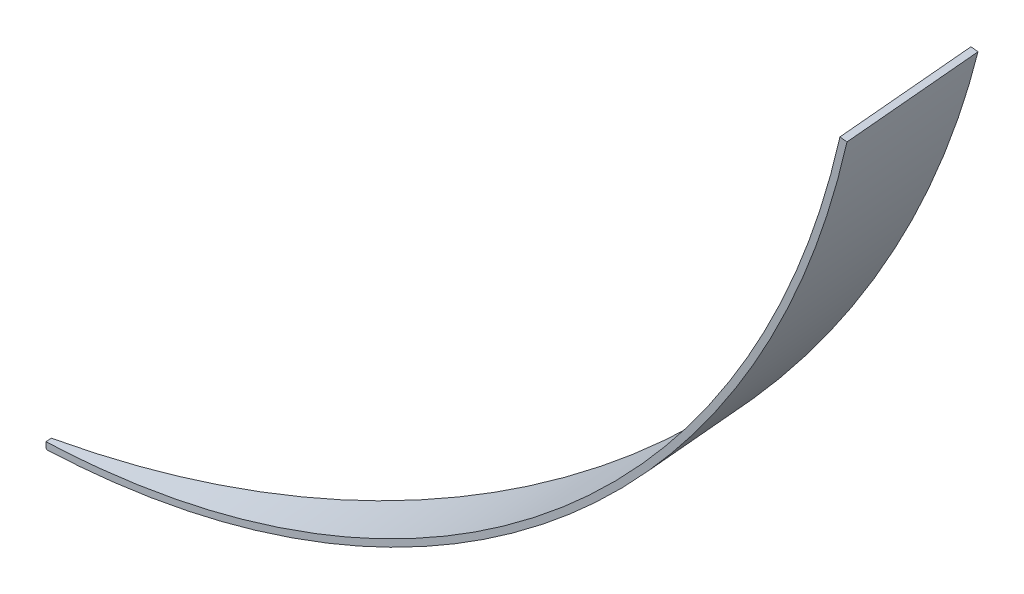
ISO-10303-21;
HEADER;
FILE_DESCRIPTION(('STEP AP214'),'2;1');
FILE_NAME('part.step','',(''),(''),'','','');
FILE_SCHEMA(('AUTOMOTIVE_DESIGN { 1 0 10303 214 1 1 1 1 }'));
ENDSEC;
DATA;
#1=APPLICATION_CONTEXT('core data for automotive mechanical design processes');
#2=APPLICATION_PROTOCOL_DEFINITION('international standard','automotive_design',2000,#1);
#3=PRODUCT_CONTEXT('',#1,'mechanical');
#4=PRODUCT('Part','Part','',(#3));
#5=PRODUCT_RELATED_PRODUCT_CATEGORY('part','',(#4));
#6=PRODUCT_DEFINITION_FORMATION('','',#4);
#7=PRODUCT_DEFINITION_CONTEXT('part definition',#1,'design');
#8=PRODUCT_DEFINITION('design','',#6,#7);
#9=PRODUCT_DEFINITION_SHAPE('','',#8);
#10=(LENGTH_UNIT() NAMED_UNIT(*) SI_UNIT(.MILLI.,.METRE.));
#11=(NAMED_UNIT(*) PLANE_ANGLE_UNIT() SI_UNIT($,.RADIAN.));
#12=(NAMED_UNIT(*) SI_UNIT($,.STERADIAN.) SOLID_ANGLE_UNIT());
#13=UNCERTAINTY_MEASURE_WITH_UNIT(LENGTH_MEASURE(1.E-05),#10,'distance_accuracy_value','');
#14=(GEOMETRIC_REPRESENTATION_CONTEXT(3) GLOBAL_UNCERTAINTY_ASSIGNED_CONTEXT((#13)) GLOBAL_UNIT_ASSIGNED_CONTEXT((#10,
#11,#12)) REPRESENTATION_CONTEXT('',''));
#15=CARTESIAN_POINT('',(0.,0.,0.));
#16=DIRECTION('',(0.,0.,1.));
#17=DIRECTION('',(1.,0.,0.));
#18=AXIS2_PLACEMENT_3D('',#15,#16,#17);
#19=CARTESIAN_POINT('',(10.0780483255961,-1.80326857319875,-0.00682834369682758));
#20=CARTESIAN_POINT('',(24.1684877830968,-1.2529459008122,-0.0163944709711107));
#21=CARTESIAN_POINT('',(38.2129792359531,0.453757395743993,-0.0258671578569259));
#22=CARTESIAN_POINT('',(65.8370291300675,6.13537077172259,-0.0446195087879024));
#23=CARTESIAN_POINT('',(79.4151253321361,10.1099770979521,-0.0537710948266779));
#24=CARTESIAN_POINT('',(105.74267664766,20.2206619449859,-0.0716217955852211));
#25=CARTESIAN_POINT('',(118.490781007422,26.3562176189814,-0.080202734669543));
#26=CARTESIAN_POINT('',(142.81694442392,40.624936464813,-0.0966741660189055));
#27=CARTESIAN_POINT('',(154.393736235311,48.7573501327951,-0.104453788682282));
#28=CARTESIAN_POINT('',(176.067254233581,66.8020546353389,-0.119102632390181));
#29=CARTESIAN_POINT('',(186.162864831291,76.713409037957,-0.125874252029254));
#30=CARTESIAN_POINT('',(204.603507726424,98.0508496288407,-0.138315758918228));
#31=CARTESIAN_POINT('',(212.947583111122,109.475819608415,-0.143901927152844));
#32=CARTESIAN_POINT('',(227.661852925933,133.534664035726,-0.153810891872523));
#33=CARTESIAN_POINT('',(234.031298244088,146.167303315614,-0.158068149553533));
#34=CARTESIAN_POINT('',(244.6251640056,172.303492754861,-0.165193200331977));
#35=CARTESIAN_POINT('',(248.849028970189,185.805662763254,-0.168012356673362));
#36=CARTESIAN_POINT('',(251.944150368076,199.562566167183,-0.170091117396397));
#37=CARTESIAN_POINT('',(10.0000000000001,0.195196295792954,0.));
#38=CARTESIAN_POINT('',(23.9810998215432,0.741216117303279,0.));
#39=CARTESIAN_POINT('',(37.9173162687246,2.43466146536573,0.));
#40=CARTESIAN_POINT('',(65.3270258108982,8.07185530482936,0.));
#41=CARTESIAN_POINT('',(78.8005189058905,12.0156037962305,0.));
#42=CARTESIAN_POINT('',(104.924035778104,22.0473373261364,0.));
#43=CARTESIAN_POINT('',(117.574059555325,28.1353223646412,0.));
#44=CARTESIAN_POINT('',(141.711953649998,42.2927715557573,0.));
#45=CARTESIAN_POINT('',(153.199823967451,50.3622357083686,0.));
#46=CARTESIAN_POINT('',(174.705904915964,68.2664785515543,0.));
#47=CARTESIAN_POINT('',(184.724115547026,78.1012572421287,0.));
#48=CARTESIAN_POINT('',(203.022551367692,99.2729020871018,0.));
#49=CARTESIAN_POINT('',(211.302776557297,110.609768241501,0.));
#50=CARTESIAN_POINT('',(225.903786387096,134.482018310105,0.));
#51=CARTESIAN_POINT('',(232.22457102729,147.01740222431,0.));
#52=CARTESIAN_POINT('',(242.736997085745,172.951145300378,0.));
#53=CARTESIAN_POINT('',(246.928638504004,186.349504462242,0.));
#54=CARTESIAN_POINT('',(250.,200.,0.));
#55=B_SPLINE_SURFACE_WITH_KNOTS('',1,3,((#19,#20,#21,#22,#23,#24,#25,#26,#27,#28,#29,#30,#31,
#32,#33,#34,#35,#36),(#37,#38,#39,#40,#41,#42,#43,#44,#45,#46,#47,#48,#49,#50,#51,#52,#53,#54)),
.UNSPECIFIED.,.F.,.F.,.F.,(2,2),(4,2,2,2,2,2,2,2,4),(0.,1.),(0.,0.125,0.25,0.375,0.5,0.625,0.75,
0.875,1.),.UNSPECIFIED.);
#56=CARTESIAN_POINT('',(251.944150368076,199.562566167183,-0.170091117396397));
#57=CARTESIAN_POINT('',(250.,200.,0.));
#58=B_SPLINE_CURVE_WITH_KNOTS('',1,(#56,#57),.UNSPECIFIED.,.F.,.F.,(2,2),(0.,1.),.UNSPECIFIED.);
#59=CARTESIAN_POINT('',(250.,200.,0.));
#60=VERTEX_POINT('',#59);
#61=CARTESIAN_POINT('',(251.944150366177,199.562566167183,-0.170091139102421));
#62=VERTEX_POINT('',#61);
#63=EDGE_CURVE('E15',#60,#62,#58,.F.);
#64=CARTESIAN_POINT('',(250.,200.,0.));
#65=CARTESIAN_POINT('',(246.928638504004,186.349504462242,0.));
#66=CARTESIAN_POINT('',(242.736997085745,172.951145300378,0.));
#67=CARTESIAN_POINT('',(232.22457102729,147.01740222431,0.));
#68=CARTESIAN_POINT('',(225.903786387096,134.482018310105,0.));
#69=CARTESIAN_POINT('',(211.302776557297,110.609768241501,0.));
#70=CARTESIAN_POINT('',(203.022551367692,99.2729020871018,0.));
#71=CARTESIAN_POINT('',(184.724115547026,78.1012572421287,0.));
#72=CARTESIAN_POINT('',(174.705904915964,68.2664785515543,0.));
#73=CARTESIAN_POINT('',(153.199823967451,50.3622357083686,0.));
#74=CARTESIAN_POINT('',(141.711953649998,42.2927715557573,0.));
#75=CARTESIAN_POINT('',(117.574059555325,28.1353223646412,0.));
#76=CARTESIAN_POINT('',(104.924035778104,22.0473373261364,0.));
#77=CARTESIAN_POINT('',(78.8005189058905,12.0156037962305,0.));
#78=CARTESIAN_POINT('',(65.3270258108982,8.07185530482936,0.));
#79=CARTESIAN_POINT('',(37.9173162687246,2.43466146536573,0.));
#80=CARTESIAN_POINT('',(23.9810998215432,0.741216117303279,0.));
#81=CARTESIAN_POINT('',(10.0000000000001,0.195196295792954,0.));
#82=B_SPLINE_CURVE_WITH_KNOTS('',3,(#64,#65,#66,#67,#68,#69,#70,#71,#72,#73,#74,#75,#76,#77,#78,
#79,#80,#81),.UNSPECIFIED.,.F.,.F.,(4,2,2,2,2,2,2,2,4),(0.,0.125,0.25,0.375,0.5,0.625,0.75,
0.875,1.),.UNSPECIFIED.);
#83=CARTESIAN_POINT('',(10.0000000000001,0.195196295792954,0.));
#84=VERTEX_POINT('',#83);
#85=EDGE_CURVE('E282',#60,#84,#82,.T.);
#86=CARTESIAN_POINT('',(10.0000000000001,0.195196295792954,0.));
#87=CARTESIAN_POINT('',(10.0780483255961,-1.80326857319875,-0.00682834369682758));
#88=B_SPLINE_CURVE_WITH_KNOTS('',1,(#86,#87),.UNSPECIFIED.,.F.,.F.,(2,2),(0.,1.),.UNSPECIFIED.);
#89=CARTESIAN_POINT('',(10.0780484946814,-1.80326856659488,-0.00682834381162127));
#90=VERTEX_POINT('',#89);
#91=EDGE_CURVE('E85',#84,#90,#88,.T.);
#92=CARTESIAN_POINT('',(251.944150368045,199.562566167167,-0.170091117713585));
#93=CARTESIAN_POINT('',(251.170376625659,196.123369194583,-0.169571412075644));
#94=CARTESIAN_POINT('',(250.326045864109,192.700058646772,-0.169005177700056));
#95=CARTESIAN_POINT('',(248.49803042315,185.890884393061,-0.1677801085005));
#96=CARTESIAN_POINT('',(247.51434715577,182.505020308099,-0.167121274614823));
#97=CARTESIAN_POINT('',(245.409371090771,175.77634310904,-0.165711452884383));
#98=CARTESIAN_POINT('',(244.288078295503,172.433529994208,-0.164960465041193));
#99=CARTESIAN_POINT('',(241.909618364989,165.796551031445,-0.163364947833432));
#100=CARTESIAN_POINT('',(240.652449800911,162.502385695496,-0.162520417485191));
#101=CARTESIAN_POINT('',(238.004009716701,155.968403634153,-0.160740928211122));
#102=CARTESIAN_POINT('',(236.612737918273,152.728587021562,-0.159805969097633));
#103=CARTESIAN_POINT('',(233.698782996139,146.308634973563,-0.157849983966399));
#104=CARTESIAN_POINT('',(232.176100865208,143.128499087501,-0.156828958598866));
#105=CARTESIAN_POINT('',(229.001977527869,136.833142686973,-0.154700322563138));
#106=CARTESIAN_POINT('',(227.350536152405,133.717922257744,-0.15359271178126));
#107=CARTESIAN_POINT('',(223.921539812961,127.557634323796,-0.151289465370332));
#108=CARTESIAN_POINT('',(222.143983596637,124.512567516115,-0.150093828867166));
#109=CARTESIAN_POINT('',(218.465452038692,118.497915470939,-0.147618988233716));
#110=CARTESIAN_POINT('',(216.564476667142,115.52833025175,-0.146339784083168));
#111=CARTESIAN_POINT('',(212.642620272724,109.669466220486,-0.143703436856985));
#112=CARTESIAN_POINT('',(210.621740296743,106.780186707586,-0.142346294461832));
#113=CARTESIAN_POINT('',(206.463534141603,101.086669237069,-0.139553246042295));
#114=CARTESIAN_POINT('',(204.326207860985,98.2824313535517,-0.138117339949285));
#115=CARTESIAN_POINT('',(199.938562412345,92.7637366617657,-0.135165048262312));
#116=CARTESIAN_POINT('',(197.688242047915,90.0492808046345,-0.133648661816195));
#117=CARTESIAN_POINT('',(193.07812687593,84.714973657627,-0.13054134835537));
#118=CARTESIAN_POINT('',(190.71833189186,82.0951225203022,-0.128950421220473));
#119=CARTESIAN_POINT('',(185.893526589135,76.9542102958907,-0.125701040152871));
#120=CARTESIAN_POINT('',(183.42851708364,74.4331484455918,-0.124042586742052));
#121=CARTESIAN_POINT('',(178.397473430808,69.4939199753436,-0.1206570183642));
#122=CARTESIAN_POINT('',(175.831439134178,67.0757535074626,-0.1189299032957));
#123=CARTESIAN_POINT('',(170.602531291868,62.3464263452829,-0.115405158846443));
#124=CARTESIAN_POINT('',(167.939656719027,60.035266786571,-0.113607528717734));
#125=CARTESIAN_POINT('',(162.521330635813,55.5241353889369,-0.109948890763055));
#126=CARTESIAN_POINT('',(159.765879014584,53.3241636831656,-0.108087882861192));
#127=CARTESIAN_POINT('',(154.167280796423,49.0388461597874,-0.104310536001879));
#128=CARTESIAN_POINT('',(151.324134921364,46.9534993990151,-0.102394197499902));
#129=CARTESIAN_POINT('',(145.554950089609,42.9008022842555,-0.0985048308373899));
#130=CARTESIAN_POINT('',(142.628911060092,40.9334520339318,-0.0965318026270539));
#131=CARTESIAN_POINT('',(136.69873744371,37.1201245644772,-0.0925270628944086));
#132=CARTESIAN_POINT('',(133.694602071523,35.2741485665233,-0.0904953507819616));
#133=CARTESIAN_POINT('',(127.613121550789,31.7070044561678,-0.0863815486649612));
#134=CARTESIAN_POINT('',(124.535776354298,29.9858364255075,-0.0842994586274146));
#135=CARTESIAN_POINT('',(118.313255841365,26.6708991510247,-0.0800939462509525));
#136=CARTESIAN_POINT('',(115.168081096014,25.0771288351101,-0.0779705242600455));
#137=CARTESIAN_POINT('',(108.815189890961,22.0195233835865,-0.0736807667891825));
#138=CARTESIAN_POINT('',(105.607473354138,20.5556884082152,-0.071514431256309));
#139=CARTESIAN_POINT('',(99.1347836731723,17.7604968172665,-0.0671368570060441));
#140=CARTESIAN_POINT('',(95.8698099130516,16.4291416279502,-0.0649256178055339));
#141=CARTESIAN_POINT('',(89.2879868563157,13.9014954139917,-0.0604672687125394));
#142=CARTESIAN_POINT('',(85.9711374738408,12.7052046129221,-0.0582201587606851));
#143=CARTESIAN_POINT('',(79.2912918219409,10.4493763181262,-0.0536996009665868));
#144=CARTESIAN_POINT('',(75.9282959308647,9.38983770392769,-0.0514261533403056));
#145=CARTESIAN_POINT('',(69.1617894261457,7.40916533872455,-0.0468512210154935));
#146=CARTESIAN_POINT('',(65.7582787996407,6.4880316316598,-0.0445497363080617));
#147=CARTESIAN_POINT('',(58.9163728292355,4.78582775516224,-0.039916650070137));
#148=CARTESIAN_POINT('',(55.477977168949,4.00475885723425,-0.0375850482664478));
#149=CARTESIAN_POINT('',(48.5720340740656,2.58436990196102,-0.032901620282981));
#150=CARTESIAN_POINT('',(45.1044866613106,1.94504973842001,-0.0305497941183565));
#151=CARTESIAN_POINT('',(38.1461694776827,0.808871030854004,-0.0258363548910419));
#152=CARTESIAN_POINT('',(34.6553999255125,0.312011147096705,-0.0234747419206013));
#153=CARTESIAN_POINT('',(27.6564588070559,-0.538557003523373,-0.0187391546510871));
#154=CARTESIAN_POINT('',(24.1482872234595,-0.892265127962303,-0.0163651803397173));
#155=CARTESIAN_POINT('',(17.1203715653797,-1.45583203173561,-0.011605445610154));
#156=CARTESIAN_POINT('',(13.6006273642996,-1.66568923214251,-0.00921968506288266));
#157=CARTESIAN_POINT('',(10.0780484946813,-1.80326856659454,-0.00682834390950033));
#158=B_SPLINE_CURVE_WITH_KNOTS('',3,(#92,#93,#94,#95,#96,#97,#98,#99,#100,#101,#102,#103,#104,
#105,#106,#107,#108,#109,#110,#111,#112,#113,#114,#115,#116,#117,#118,#119,#120,#121,#122,#123,
#124,#125,#126,#127,#128,#129,#130,#131,#132,#133,#134,#135,#136,#137,#138,#139,#140,#141,#142,
#143,#144,#145,#146,#147,#148,#149,#150,#151,#152,#153,#154,#155,#156,#157),.UNSPECIFIED.,.F.,
.F.,(4,2,2,2,2,2,2,2,2,2,2,2,2,2,2,2,2,2,2,2,2,2,2,2,2,2,2,2,2,2,2,2,4),(0.,10.5747437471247,
21.1493803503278,31.7240167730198,42.2987644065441,52.8735339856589,63.4482236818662,
74.022927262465,84.5977358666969,95.1725470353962,105.74726588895,116.321993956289,
126.896834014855,137.471691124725,148.046466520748,158.621257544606,169.196160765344,
179.771076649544,190.345905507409,200.920743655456,211.495688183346,222.070639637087,
232.645502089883,243.220377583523,253.795366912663,264.370373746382,274.945293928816,
285.5202174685,296.095237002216,306.670248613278,317.245160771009,327.820083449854,
338.395122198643),.UNSPECIFIED.);
#159=EDGE_CURVE('E138',#62,#90,#158,.T.);
#160=ORIENTED_EDGE('',*,*,#63,.F.);
#161=ORIENTED_EDGE('',*,*,#85,.T.);
#162=ORIENTED_EDGE('',*,*,#91,.T.);
#163=ORIENTED_EDGE('',*,*,#159,.F.);
#164=EDGE_LOOP('',(#160,#161,#162,#163));
#165=FACE_BOUND('',#164,.T.);
#166=ADVANCED_FACE('F73',(#165),#55,.F.);
#167=CARTESIAN_POINT('',(10.0780483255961,-1.80326857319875,-0.00682834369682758));
#168=DIRECTION('',(-0.995430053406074,-0.0391732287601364,0.0870888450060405));
#169=DIRECTION('',(-0.0390241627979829,0.999232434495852,0.00341417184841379));
#170=AXIS2_PLACEMENT_3D('',#167,#168,#169);
#171=PLANE('',#170);
#172=ORIENTED_EDGE('',*,*,#91,.F.);
#173=CARTESIAN_POINT('',(9.84807753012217,0.195196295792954,-1.73648177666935));
#174=CARTESIAN_POINT('',(10.0000000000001,0.195196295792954,0.));
#175=B_SPLINE_CURVE_WITH_KNOTS('',1,(#173,#174),.UNSPECIFIED.,.F.,.F.,(2,2),(0.,1.),.UNSPECIFIED.);
#176=CARTESIAN_POINT('',(9.84807753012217,0.195196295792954,-1.73648177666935));
#177=VERTEX_POINT('',#176);
#178=EDGE_CURVE('E121',#84,#177,#175,.F.);
#179=ORIENTED_EDGE('',*,*,#178,.T.);
#180=CARTESIAN_POINT('',(9.92612585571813,-1.80326857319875,-1.74331012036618));
#181=CARTESIAN_POINT('',(9.84807753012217,0.195196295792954,-1.73648177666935));
#182=B_SPLINE_CURVE_WITH_KNOTS('',1,(#180,#181),.UNSPECIFIED.,.F.,.F.,(2,2),(0.,1.),.UNSPECIFIED.);
#183=CARTESIAN_POINT('',(9.92612585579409,-1.80326857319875,-1.74331011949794));
#184=VERTEX_POINT('',#183);
#185=EDGE_CURVE('E115',#177,#184,#182,.F.);
#186=ORIENTED_EDGE('',*,*,#185,.T.);
#187=CARTESIAN_POINT('',(10.0780483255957,-1.8032685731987,-0.00682834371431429));
#188=CARTESIAN_POINT('',(10.0717182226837,-1.80326857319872,-0.079181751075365));
#189=CARTESIAN_POINT('',(10.0653881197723,-1.80326857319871,-0.151535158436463));
#190=CARTESIAN_POINT('',(10.0527279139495,-1.8032685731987,-0.296241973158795));
#191=CARTESIAN_POINT('',(10.046397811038,-1.8032685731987,-0.368595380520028));
#192=CARTESIAN_POINT('',(10.033737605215,-1.80326857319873,-0.513302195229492));
#193=CARTESIAN_POINT('',(10.0274075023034,-1.80326857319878,-0.585655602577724));
#194=CARTESIAN_POINT('',(10.0147472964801,-1.80326857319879,-0.730362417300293));
#195=CARTESIAN_POINT('',(10.0084171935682,-1.80326857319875,-0.802715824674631));
#196=CARTESIAN_POINT('',(9.9957569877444,-1.80326857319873,-0.947422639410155));
#197=CARTESIAN_POINT('',(9.98942688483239,-1.80326857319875,-1.01977604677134));
#198=CARTESIAN_POINT('',(9.97676667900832,-1.80326857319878,-1.16448286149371));
#199=CARTESIAN_POINT('',(9.97043657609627,-1.8032685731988,-1.23683626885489));
#200=CARTESIAN_POINT('',(9.95777637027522,-1.80326857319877,-1.38154308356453));
#201=CARTESIAN_POINT('',(9.95144626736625,-1.80326857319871,-1.45389649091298));
#202=CARTESIAN_POINT('',(9.93878606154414,-1.80326857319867,-1.59860330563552));
#203=CARTESIAN_POINT('',(9.93245595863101,-1.80326857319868,-1.6709567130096));
#204=CARTESIAN_POINT('',(9.92612585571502,-1.80326857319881,-1.74331012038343));
#205=B_SPLINE_CURVE_WITH_KNOTS('',3,(#187,#188,#189,#190,#191,#192,#193,#194,#195,#196,#197,
#198,#199,#200,#201,#202,#203,#204),.UNSPECIFIED.,.F.,.F.,(4,2,2,2,2,2,2,2,4),(0.,
0.217889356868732,0.435778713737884,0.653668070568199,0.871557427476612,1.08944678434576,
1.30733614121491,1.52522549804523,1.74311485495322),.UNSPECIFIED.);
#206=EDGE_CURVE('E119',#90,#184,#205,.T.);
#207=ORIENTED_EDGE('',*,*,#206,.F.);
#208=EDGE_LOOP('',(#172,#179,#186,#207));
#209=FACE_BOUND('',#208,.T.);
#210=ADVANCED_FACE('F118',(#209),#171,.T.);
#211=CARTESIAN_POINT('',(9.92612585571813,-1.80326857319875,-1.74331012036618));
#212=CARTESIAN_POINT('',(23.8041610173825,-1.2529459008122,-4.18066845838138));
#213=CARTESIAN_POINT('',(37.6369300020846,0.453757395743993,-6.61014002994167));
#214=CARTESIAN_POINT('',(64.8445648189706,6.13537077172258,-11.388538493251));
#215=CARTESIAN_POINT('',(78.2179683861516,10.1099770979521,-13.7373376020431));
#216=CARTESIAN_POINT('',(104.148644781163,20.2206619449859,-18.2914894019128));
#217=CARTESIAN_POINT('',(116.7045668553,26.3562176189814,-20.4967239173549));
#218=CARTESIAN_POINT('',(140.664021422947,40.624936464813,-24.7046966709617));
#219=CARTESIAN_POINT('',(152.066286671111,48.7573501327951,-26.7073240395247));
#220=CARTESIAN_POINT('',(173.413078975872,66.8020546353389,-30.4564646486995));
#221=CARTESIAN_POINT('',(183.3564904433,76.7134090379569,-32.2028802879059));
#222=CARTESIAN_POINT('',(201.519138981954,98.0508496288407,-35.3928118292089));
#223=CARTESIAN_POINT('',(209.737419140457,109.475819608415,-36.83624401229));
#224=CARTESIAN_POINT('',(224.229866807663,133.534664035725,-39.3815917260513));
#225=CARTESIAN_POINT('',(230.503285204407,146.167303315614,-40.4834417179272));
#226=CARTESIAN_POINT('',(240.937443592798,172.303492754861,-42.3160303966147));
#227=CARTESIAN_POINT('',(245.097628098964,185.805662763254,-43.0467205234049));
#228=CARTESIAN_POINT('',(248.146088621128,199.562566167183,-43.5821355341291));
#229=CARTESIAN_POINT('',(9.84807753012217,0.195196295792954,-1.73648177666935));
#230=CARTESIAN_POINT('',(23.6167730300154,0.741216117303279,-4.16427428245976));
#231=CARTESIAN_POINT('',(37.341267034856,2.43466146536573,-6.58427287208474));
#232=CARTESIAN_POINT('',(64.3345614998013,8.07185530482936,-11.3439189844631));
#233=CARTESIAN_POINT('',(77.6033619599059,12.0156037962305,-13.6835665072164));
#234=CARTESIAN_POINT('',(103.330003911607,22.0473373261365,-18.2198676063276));
#235=CARTESIAN_POINT('',(115.787845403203,28.1353223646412,-20.4165211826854));
#236=CARTESIAN_POINT('',(139.559030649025,42.2927715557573,-24.6080225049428));
#237=CARTESIAN_POINT('',(150.872374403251,50.3622357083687,-26.6028702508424));
#238=CARTESIAN_POINT('',(172.051729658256,68.2664785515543,-30.3373620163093));
#239=CARTESIAN_POINT('',(181.917741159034,78.1012572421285,-32.0770060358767));
#240=CARTESIAN_POINT('',(199.938182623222,99.2729020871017,-35.2544960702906));
#241=CARTESIAN_POINT('',(208.092612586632,110.609768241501,-36.6923420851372));
#242=CARTESIAN_POINT('',(222.471800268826,134.482018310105,-39.2277808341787));
#243=CARTESIAN_POINT('',(228.69655798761,147.017402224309,-40.3253735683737));
#244=CARTESIAN_POINT('',(239.049276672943,172.951145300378,-42.1508371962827));
#245=CARTESIAN_POINT('',(243.177237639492,186.349504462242,-42.8787080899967));
#246=CARTESIAN_POINT('',(246.201938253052,200.,-43.4120444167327));
#247=B_SPLINE_SURFACE_WITH_KNOTS('',1,3,((#211,#212,#213,#214,#215,#216,#217,#218,#219,#220,
#221,#222,#223,#224,#225,#226,#227,#228),(#229,#230,#231,#232,#233,#234,#235,#236,#237,#238,
#239,#240,#241,#242,#243,#244,#245,#246)),.UNSPECIFIED.,.F.,.F.,.F.,(2,2),(4,2,2,2,2,2,2,2,4),
(0.,1.),(0.,0.125,0.25,0.375,0.5,0.625,0.75,0.875,1.),.UNSPECIFIED.);
#248=CARTESIAN_POINT('',(9.84807753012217,0.195196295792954,-1.73648177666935));
#249=CARTESIAN_POINT('',(23.6167730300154,0.741216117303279,-4.16427428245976));
#250=CARTESIAN_POINT('',(37.341267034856,2.43466146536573,-6.58427287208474));
#251=CARTESIAN_POINT('',(64.3345614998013,8.07185530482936,-11.3439189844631));
#252=CARTESIAN_POINT('',(77.6033619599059,12.0156037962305,-13.6835665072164));
#253=CARTESIAN_POINT('',(103.330003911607,22.0473373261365,-18.2198676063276));
#254=CARTESIAN_POINT('',(115.787845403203,28.1353223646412,-20.4165211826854));
#255=CARTESIAN_POINT('',(139.559030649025,42.2927715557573,-24.6080225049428));
#256=CARTESIAN_POINT('',(150.872374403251,50.3622357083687,-26.6028702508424));
#257=CARTESIAN_POINT('',(172.051729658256,68.2664785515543,-30.3373620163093));
#258=CARTESIAN_POINT('',(181.917741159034,78.1012572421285,-32.0770060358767));
#259=CARTESIAN_POINT('',(199.938182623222,99.2729020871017,-35.2544960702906));
#260=CARTESIAN_POINT('',(208.092612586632,110.609768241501,-36.6923420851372));
#261=CARTESIAN_POINT('',(222.471800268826,134.482018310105,-39.2277808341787));
#262=CARTESIAN_POINT('',(228.69655798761,147.017402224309,-40.3253735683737));
#263=CARTESIAN_POINT('',(239.049276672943,172.951145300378,-42.1508371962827));
#264=CARTESIAN_POINT('',(243.177237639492,186.349504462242,-42.8787080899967));
#265=CARTESIAN_POINT('',(246.201938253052,200.,-43.4120444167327));
#266=B_SPLINE_CURVE_WITH_KNOTS('',3,(#248,#249,#250,#251,#252,#253,#254,#255,#256,#257,#258,
#259,#260,#261,#262,#263,#264,#265),.UNSPECIFIED.,.F.,.F.,(4,2,2,2,2,2,2,2,4),(0.,0.125,0.25,
0.375,0.5,0.625,0.75,0.875,1.),.UNSPECIFIED.);
#267=CARTESIAN_POINT('',(246.201938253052,200.,-43.4120444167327));
#268=VERTEX_POINT('',#267);
#269=EDGE_CURVE('E140',#177,#268,#266,.T.);
#270=CARTESIAN_POINT('',(246.201938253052,200.,-43.4120444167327));
#271=CARTESIAN_POINT('',(248.146088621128,199.562566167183,-43.5821355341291));
#272=B_SPLINE_CURVE_WITH_KNOTS('',1,(#270,#271),.UNSPECIFIED.,.F.,.F.,(2,2),(0.,1.),.UNSPECIFIED.);
#273=CARTESIAN_POINT('',(248.146088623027,199.562566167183,-43.5821355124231));
#274=VERTEX_POINT('',#273);
#275=EDGE_CURVE('E128',#268,#274,#272,.T.);
#276=CARTESIAN_POINT('',(9.92612585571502,-1.80326857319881,-1.74331012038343));
#277=CARTESIAN_POINT('',(13.3956040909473,-1.66568924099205,-2.352644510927));
#278=CARTESIAN_POINT('',(16.8622897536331,-1.4558320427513,-2.96149216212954));
#279=CARTESIAN_POINT('',(23.7842621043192,-0.892265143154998,-4.17718948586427));
#280=CARTESIAN_POINT('',(27.239548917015,-0.53855702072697,-4.78403918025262));
#281=CARTESIAN_POINT('',(34.1329827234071,0.312011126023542,-5.99472890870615));
#282=CARTESIAN_POINT('',(37.5711297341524,0.80887100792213,-6.59856894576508));
#283=CARTESIAN_POINT('',(44.4245529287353,1.94504971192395,-7.80222621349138));
#284=CARTESIAN_POINT('',(47.8398288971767,2.5843698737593,-8.40204340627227));
#285=CARTESIAN_POINT('',(54.641668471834,4.00475882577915,-9.59663556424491));
#286=CARTESIAN_POINT('',(58.028232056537,4.78582772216,-10.1914105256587));
#287=CARTESIAN_POINT('',(64.766998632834,6.48803159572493,-11.3749323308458));
#288=CARTESIAN_POINT('',(68.119201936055,7.40916530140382,-11.9636792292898));
#289=CARTESIAN_POINT('',(74.7837044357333,9.3898376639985,-13.1341653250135));
#290=CARTESIAN_POINT('',(78.0960036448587,10.4493762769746,-13.7159045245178));
#291=CARTESIAN_POINT('',(84.6751524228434,12.7052045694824,-14.8713956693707));
#292=CARTESIAN_POINT('',(87.9420016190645,13.9014953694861,-15.4451475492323));
#293=CARTESIAN_POINT('',(94.4246061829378,16.429141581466,-16.583678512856));
#294=CARTESIAN_POINT('',(97.6403616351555,17.7604967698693,-17.1484576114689));
#295=CARTESIAN_POINT('',(104.015476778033,20.5556883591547,-18.268117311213));
#296=CARTESIAN_POINT('',(107.174837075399,22.0195233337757,-18.822998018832));
#297=CARTESIAN_POINT('',(113.431958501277,25.0771287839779,-19.921941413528));
#298=CARTESIAN_POINT('',(116.52971970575,26.6708990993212,-20.4660041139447));
#299=CARTESIAN_POINT('',(122.658436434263,29.9858363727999,-21.5423918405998));
#300=CARTESIAN_POINT('',(125.68939139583,31.7070044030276,-22.0747167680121));
#301=CARTESIAN_POINT('',(131.679194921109,35.2741485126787,-23.1267034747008));
#302=CARTESIAN_POINT('',(134.638043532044,37.1201245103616,-23.6463652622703));
#303=CARTESIAN_POINT('',(140.478819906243,40.9334519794,-24.6721852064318));
#304=CARTESIAN_POINT('',(143.360748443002,42.9008022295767,-25.1783434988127));
#305=CARTESIAN_POINT('',(149.042961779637,46.9534993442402,-26.1763216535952));
#306=CARTESIAN_POINT('',(151.843246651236,49.0388461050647,-26.6681415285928));
#307=CARTESIAN_POINT('',(157.357445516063,53.3241636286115,-27.636607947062));
#308=CARTESIAN_POINT('',(160.071358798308,55.5241353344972,-28.1132543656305));
#309=CARTESIAN_POINT('',(165.408003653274,60.0352667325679,-29.0505337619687));
#310=CARTESIAN_POINT('',(168.030735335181,62.3464262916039,-29.5111667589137));
#311=CARTESIAN_POINT('',(173.180816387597,67.0757534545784,-30.4156858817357));
#312=CARTESIAN_POINT('',(175.708166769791,69.4939199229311,-30.8595721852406));
#313=CARTESIAN_POINT('',(180.663365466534,74.4331483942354,-31.7298696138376));
#314=CARTESIAN_POINT('',(183.091213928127,76.9542102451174,-32.1562807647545));
#315=CARTESIAN_POINT('',(187.843283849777,82.0951224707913,-32.9908993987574));
#316=CARTESIAN_POINT('',(190.167504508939,84.7149736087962,-33.3991067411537));
#317=CARTESIAN_POINT('',(194.708121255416,90.0492807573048,-34.1965847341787));
#318=CARTESIAN_POINT('',(196.924517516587,92.7637366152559,-34.5858554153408));
#319=CARTESIAN_POINT('',(201.246017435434,98.2824313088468,-35.3448546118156));
#320=CARTESIAN_POINT('',(203.351122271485,101.086669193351,-35.7145833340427));
#321=CARTESIAN_POINT('',(207.446640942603,106.780186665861,-36.4338976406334));
#322=CARTESIAN_POINT('',(209.437054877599,109.669466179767,-36.7834832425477));
#323=CARTESIAN_POINT('',(213.299787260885,115.528330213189,-37.4619101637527));
#324=CARTESIAN_POINT('',(215.172104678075,118.49791543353,-37.7907513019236));
#325=CARTESIAN_POINT('',(218.795180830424,124.512567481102,-38.4270843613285));
#326=CARTESIAN_POINT('',(220.545939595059,127.55763429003,-38.7345762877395));
#327=CARTESIAN_POINT('',(223.923241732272,133.717922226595,-39.3277469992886));
#328=CARTESIAN_POINT('',(225.549786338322,136.833142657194,-39.6134260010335));
#329=CARTESIAN_POINT('',(228.67605724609,143.128499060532,-40.1625104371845));
#330=CARTESIAN_POINT('',(230.175783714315,146.308634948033,-40.425915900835));
#331=CARTESIAN_POINT('',(233.045808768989,152.728586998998,-40.929992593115));
#332=CARTESIAN_POINT('',(234.416106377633,155.968403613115,-41.1706636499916));
#333=CARTESIAN_POINT('',(237.024619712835,162.502385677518,-41.6288079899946));
#334=CARTESIAN_POINT('',(238.262835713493,165.796551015,-41.846281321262));
#335=CARTESIAN_POINT('',(240.605438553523,172.433529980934,-42.2577252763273));
#336=CARTESIAN_POINT('',(241.709826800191,175.776343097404,-42.4516961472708));
#337=CARTESIAN_POINT('',(243.783068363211,182.505020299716,-42.8158330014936));
#338=CARTESIAN_POINT('',(244.751921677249,185.890884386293,-42.9859989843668));
#339=CARTESIAN_POINT('',(246.552378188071,192.700058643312,-43.3022240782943));
#340=CARTESIAN_POINT('',(247.383979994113,196.123369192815,-43.4482829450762));
#341=CARTESIAN_POINT('',(248.146088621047,199.562566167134,-43.5821355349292));
#342=B_SPLINE_CURVE_WITH_KNOTS('',3,(#276,#277,#278,#279,#280,#281,#282,#283,#284,#285,#286,
#287,#288,#289,#290,#291,#292,#293,#294,#295,#296,#297,#298,#299,#300,#301,#302,#303,#304,#305,
#306,#307,#308,#309,#310,#311,#312,#313,#314,#315,#316,#317,#318,#319,#320,#321,#322,#323,#324,
#325,#326,#327,#328,#329,#330,#331,#332,#333,#334,#335,#336,#337,#338,#339,#340,#341),
.UNSPECIFIED.,.F.,.F.,(4,2,2,2,2,2,2,2,2,2,2,2,2,2,2,2,2,2,2,2,2,2,2,2,2,2,2,2,2,2,2,2,4),(0.,
10.57503875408,21.1499614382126,31.7248736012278,42.2998852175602,52.8749047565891,
63.4498283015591,74.0247484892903,84.599755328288,95.1747446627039,105.749620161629,
116.32448261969,126.899434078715,137.474378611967,148.049216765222,158.624045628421,
169.198961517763,179.773864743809,190.348655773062,200.923431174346,211.498288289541,
222.073128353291,232.647856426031,243.222575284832,253.797386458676,264.372195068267,
274.946898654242,285.521588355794,296.096357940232,306.671105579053,317.245742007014,
327.820378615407,338.395122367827),.UNSPECIFIED.);
#343=EDGE_CURVE('E136',#184,#274,#342,.T.);
#344=ORIENTED_EDGE('',*,*,#185,.F.);
#345=ORIENTED_EDGE('',*,*,#269,.T.);
#346=ORIENTED_EDGE('',*,*,#275,.T.);
#347=ORIENTED_EDGE('',*,*,#343,.F.);
#348=EDGE_LOOP('',(#344,#345,#346,#347));
#349=FACE_BOUND('',#348,.T.);
#350=ADVANCED_FACE('F145',(#349),#247,.T.);
#351=CARTESIAN_POINT('',(248.146088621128,199.562566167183,-43.5821355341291));
#352=DIRECTION('',(0.217884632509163,0.975788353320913,-0.0190624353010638));
#353=DIRECTION('',(-0.972075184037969,0.21871691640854,0.0850455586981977));
#354=AXIS2_PLACEMENT_3D('',#351,#352,#353);
#355=PLANE('',#354);
#356=CARTESIAN_POINT('',(250.,200.,0.));
#357=CARTESIAN_POINT('',(246.201938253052,200.,-43.4120444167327));
#358=B_SPLINE_CURVE_WITH_KNOTS('',1,(#356,#357),.UNSPECIFIED.,.F.,.F.,(2,2),(0.,1.),.UNSPECIFIED.);
#359=EDGE_CURVE('E253',#268,#60,#358,.F.);
#360=ORIENTED_EDGE('',*,*,#359,.T.);
#361=ORIENTED_EDGE('',*,*,#63,.T.);
#362=CARTESIAN_POINT('',(248.146088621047,199.562566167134,-43.5821355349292));
#363=CARTESIAN_POINT('',(248.304341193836,199.562566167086,-41.7733003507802));
#364=CARTESIAN_POINT('',(248.462593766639,199.5625661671,-39.9644651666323));
#365=CARTESIAN_POINT('',(248.779098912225,199.562566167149,-36.3467947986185));
#366=CARTESIAN_POINT('',(248.937351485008,199.562566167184,-34.5379596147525));
#367=CARTESIAN_POINT('',(249.253856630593,199.562566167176,-30.9202892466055));
#368=CARTESIAN_POINT('',(249.412109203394,199.562566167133,-29.1114540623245));
#369=CARTESIAN_POINT('',(249.728614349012,199.562566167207,-25.4937836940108));
#370=CARTESIAN_POINT('',(249.886866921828,199.562566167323,-23.6849485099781));
#371=CARTESIAN_POINT('',(250.203372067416,199.562566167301,-20.0672781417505));
#372=CARTESIAN_POINT('',(250.361624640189,199.562566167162,-18.2584429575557));
#373=CARTESIAN_POINT('',(250.678129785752,199.562566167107,-14.6407725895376));
#374=CARTESIAN_POINT('',(250.836382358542,199.562566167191,-12.8319374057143));
#375=CARTESIAN_POINT('',(251.152887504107,199.56256616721,-9.21426703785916));
#376=CARTESIAN_POINT('',(251.311140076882,199.562566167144,-7.40543185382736));
#377=CARTESIAN_POINT('',(251.627645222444,199.562566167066,-3.7877614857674));
#378=CARTESIAN_POINT('',(251.78589779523,199.562566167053,-1.97892630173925));
#379=CARTESIAN_POINT('',(251.944150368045,199.562566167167,-0.170091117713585));
#380=B_SPLINE_CURVE_WITH_KNOTS('',3,(#362,#363,#364,#365,#366,#367,#368,#369,#370,#371,#372,
#373,#374,#375,#376,#377,#378,#379),.UNSPECIFIED.,.F.,.F.,(4,2,2,2,2,2,2,2,4),(0.,
5.44723392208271,10.894467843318,16.3417017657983,21.7889356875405,27.2361696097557,
32.6834035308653,38.1306374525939,43.5778713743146),.UNSPECIFIED.);
#381=EDGE_CURVE('E148',#274,#62,#380,.T.);
#382=ORIENTED_EDGE('',*,*,#381,.F.);
#383=ORIENTED_EDGE('',*,*,#275,.F.);
#384=EDGE_LOOP('',(#360,#361,#382,#383));
#385=FACE_BOUND('',#384,.T.);
#386=ADVANCED_FACE('F75',(#385),#355,.T.);
#387=CARTESIAN_POINT('',(9.84807753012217,0.195196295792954,-1.73648177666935));
#388=CARTESIAN_POINT('',(10.0000000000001,0.195196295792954,0.));
#389=CARTESIAN_POINT('',(23.6167730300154,0.741216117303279,-4.16427428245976));
#390=CARTESIAN_POINT('',(23.9810998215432,0.741216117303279,0.));
#391=CARTESIAN_POINT('',(51.0657610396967,4.12810681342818,-9.00427146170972));
#392=CARTESIAN_POINT('',(51.853532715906,4.12810681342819,0.));
#393=CARTESIAN_POINT('',(90.8721624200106,15.9593522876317,-16.0232140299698));
#394=CARTESIAN_POINT('',(92.2740120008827,15.9593522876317,0.));
#395=CARTESIAN_POINT('',(128.245686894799,34.223307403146,-22.6131747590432));
#396=CARTESIAN_POINT('',(130.224083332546,34.2233074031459,0.));
#397=CARTESIAN_POINT('',(162.185718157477,58.43169986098,-28.597717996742));
#398=CARTESIAN_POINT('',(164.687694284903,58.43169986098,0.));
#399=CARTESIAN_POINT('',(191.783752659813,87.9360359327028,-33.816650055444));
#400=CARTESIAN_POINT('',(194.742326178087,87.936035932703,0.));
#401=CARTESIAN_POINT('',(216.247042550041,121.9466343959,-38.1301880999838));
#402=CARTESIAN_POINT('',(219.583001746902,121.946634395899,0.));
#403=CARTESIAN_POINT('',(234.921315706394,159.552786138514,-41.4229663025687));
#404=CARTESIAN_POINT('',(238.545355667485,159.552786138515,0.));
#405=CARTESIAN_POINT('',(243.177237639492,186.349504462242,-42.8787080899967));
#406=CARTESIAN_POINT('',(246.928638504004,186.349504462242,0.));
#407=CARTESIAN_POINT('',(246.201938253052,200.,-43.4120444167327));
#408=CARTESIAN_POINT('',(250.,200.,0.));
#409=B_SPLINE_SURFACE_WITH_KNOTS('',3,1,((#387,#388),(#389,#390),(#391,#392),(#393,#394),(#395,
#396),(#397,#398),(#399,#400),(#401,#402),(#403,#404),(#405,#406),(#407,#408)),.UNSPECIFIED.,
.F.,.F.,.F.,(4,1,1,1,1,1,1,1,4),(2,2),(0.,0.125,0.25,0.375,0.5,0.625,0.75,0.875,1.),(0.,1.),.UNSPECIFIED.);
#410=OFFSET_SURFACE('',#409,2.,.F.);
#411=ORIENTED_EDGE('',*,*,#343,.T.);
#412=ORIENTED_EDGE('',*,*,#381,.T.);
#413=ORIENTED_EDGE('',*,*,#159,.T.);
#414=ORIENTED_EDGE('',*,*,#206,.T.);
#415=EDGE_LOOP('',(#411,#412,#413,#414));
#416=FACE_BOUND('',#415,.T.);
#417=ADVANCED_FACE('F134',(#416),#410,.T.);
#418=CARTESIAN_POINT('',(9.84807753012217,0.195196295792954,-1.73648177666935));
#419=CARTESIAN_POINT('',(10.0000000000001,0.195196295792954,0.));
#420=CARTESIAN_POINT('',(23.6167730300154,0.741216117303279,-4.16427428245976));
#421=CARTESIAN_POINT('',(23.9810998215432,0.741216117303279,0.));
#422=CARTESIAN_POINT('',(51.0657610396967,4.12810681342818,-9.00427146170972));
#423=CARTESIAN_POINT('',(51.853532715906,4.12810681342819,0.));
#424=CARTESIAN_POINT('',(90.8721624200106,15.9593522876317,-16.0232140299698));
#425=CARTESIAN_POINT('',(92.2740120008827,15.9593522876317,0.));
#426=CARTESIAN_POINT('',(128.245686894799,34.223307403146,-22.6131747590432));
#427=CARTESIAN_POINT('',(130.224083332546,34.2233074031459,0.));
#428=CARTESIAN_POINT('',(162.185718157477,58.43169986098,-28.597717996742));
#429=CARTESIAN_POINT('',(164.687694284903,58.43169986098,0.));
#430=CARTESIAN_POINT('',(191.783752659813,87.9360359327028,-33.816650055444));
#431=CARTESIAN_POINT('',(194.742326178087,87.936035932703,0.));
#432=CARTESIAN_POINT('',(216.247042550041,121.9466343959,-38.1301880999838));
#433=CARTESIAN_POINT('',(219.583001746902,121.946634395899,0.));
#434=CARTESIAN_POINT('',(234.921315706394,159.552786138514,-41.4229663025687));
#435=CARTESIAN_POINT('',(238.545355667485,159.552786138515,0.));
#436=CARTESIAN_POINT('',(243.177237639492,186.349504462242,-42.8787080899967));
#437=CARTESIAN_POINT('',(246.928638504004,186.349504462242,0.));
#438=CARTESIAN_POINT('',(246.201938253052,200.,-43.4120444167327));
#439=CARTESIAN_POINT('',(250.,200.,0.));
#440=B_SPLINE_SURFACE_WITH_KNOTS('',3,1,((#418,#419),(#420,#421),(#422,#423),(#424,#425),(#426,
#427),(#428,#429),(#430,#431),(#432,#433),(#434,#435),(#436,#437),(#438,#439)),.UNSPECIFIED.,
.F.,.F.,.F.,(4,1,1,1,1,1,1,1,4),(2,2),(0.,0.125,0.25,0.375,0.5,0.625,0.75,0.875,1.),(0.,1.),.UNSPECIFIED.);
#441=ORIENTED_EDGE('',*,*,#269,.F.);
#442=ORIENTED_EDGE('',*,*,#178,.F.);
#443=ORIENTED_EDGE('',*,*,#85,.F.);
#444=ORIENTED_EDGE('',*,*,#359,.F.);
#445=EDGE_LOOP('',(#441,#442,#443,#444));
#446=FACE_BOUND('',#445,.T.);
#447=ADVANCED_FACE('F281',(#446),#440,.F.);
#448=CLOSED_SHELL('',(#166,#210,#350,#386,#417,#447));
#449=MANIFOLD_SOLID_BREP('B2',#448);
#450=ADVANCED_BREP_SHAPE_REPRESENTATION('',(#18,#449),#14);
#451=SHAPE_DEFINITION_REPRESENTATION(#9,#450);
ENDSEC;
END-ISO-10303-21;
